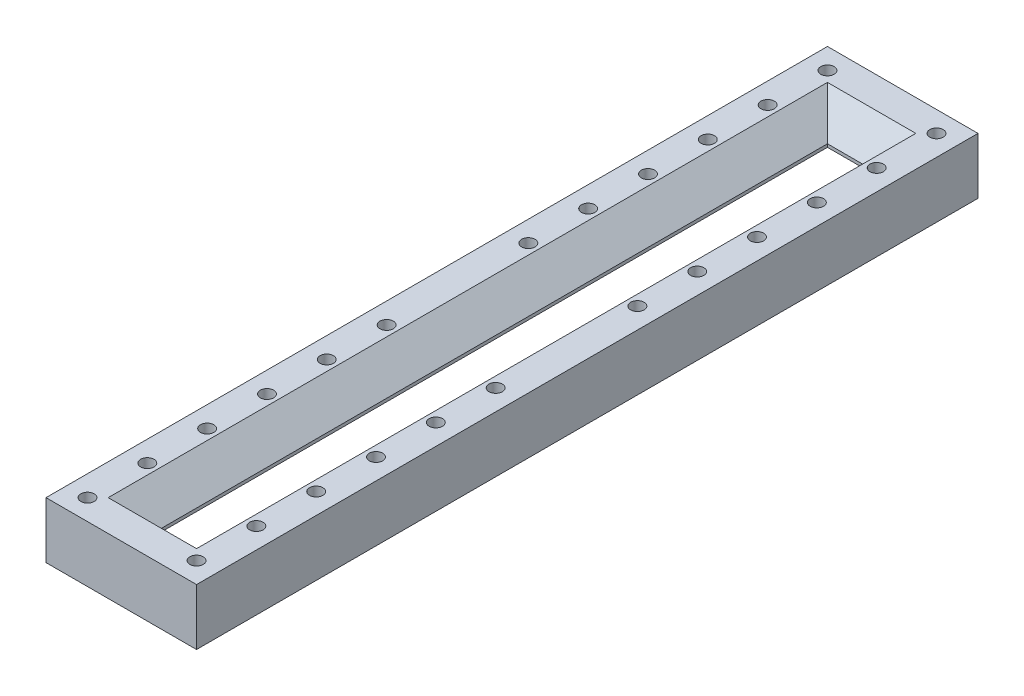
from build123d import *

# Parameters (mm, degrees)
SKETCH2_W           = 679.45
SKETCH2_H           = 3527.05
SKETCH2_W_2         = 158.75
SKETCH2_H_2         = 3006.35
BOSS_EXTRUDE2_DEPTH = 254
SKETCH3_R           = 30.1625
CUT_EXTRUDE1_DEPTH  = 1814.821794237
CHAMFER1_SIZE       = 120


with BuildPart() as part:
    # Sketch2 → Boss-Extrude2 (new body)
    with BuildSketch(Plane(origin=(0, 0, 0), x_dir=(-1, 0, 0), z_dir=(0, 1, 0))):
        Rectangle(SKETCH2_W, SKETCH2_H)
        Rectangle(SKETCH2_W_2, SKETCH2_H_2, mode=Mode.SUBTRACT)
    extrude(amount=BOSS_EXTRUDE2_DEPTH)

    # Sketch3 → Cut-Extrude1 (cut, through all)
    with BuildSketch(Plane(origin=(0, 0, 0), x_dir=(-1, 0, 0), z_dir=(0, 1, 0))):
        with Locations(Location((-246.0625, 1669.8625, 0), (0, 0, 90))):
            Circle(SKETCH3_R)
        with Locations(Location((246.0625, 1669.8625, 0), (0, 0, 90))):
            Circle(SKETCH3_R)
        with Locations(Location((-246.0625, 1399.8625, 0), (0, 0, 90))):
            Circle(SKETCH3_R)
        with Locations(Location((246.0625, 1399.8625, 0), (0, 0, 90))):
            Circle(SKETCH3_R)
        with Locations(Location((-246.0625, 1129.8625, 0), (0, 0, 90))):
            Circle(SKETCH3_R)
        with Locations(Location((246.0625, 1129.8625, 0), (0, 0, 90))):
            Circle(SKETCH3_R)
        with Locations(Location((-246.0625, 859.8625, 0), (0, 0, 90))):
            Circle(SKETCH3_R)
        with Locations(Location((246.0625, 859.8625, 0), (0, 0, 90))):
            Circle(SKETCH3_R)
        with Locations(Location((-246.0625, 589.8625, 0), (0, 0, 90))):
            Circle(SKETCH3_R)
        with Locations(Location((246.0625, 589.8625, 0), (0, 0, 90))):
            Circle(SKETCH3_R)
        with Locations(Location((-246.0625, -1669.8625, 0), (0, 0, 90))):
            Circle(SKETCH3_R)
        with Locations(Location((246.0625, -1669.8625, 0), (0, 0, 90))):
            Circle(SKETCH3_R)
        with Locations(Location((-246.0625, -1399.8625, 0), (0, 0, 90))):
            Circle(SKETCH3_R)
        with Locations(Location((246.0625, -1399.8625, 0), (0, 0, 90))):
            Circle(SKETCH3_R)
        with Locations(Location((-246.0625, -1129.8625, 0), (0, 0, 90))):
            Circle(SKETCH3_R)
        with Locations(Location((246.0625, -1129.8625, 0), (0, 0, 90))):
            Circle(SKETCH3_R)
        with Locations(Location((-246.0625, -859.8625, 0), (0, 0, 90))):
            Circle(SKETCH3_R)
        with Locations(Location((246.0625, -859.8625, 0), (0, 0, 90))):
            Circle(SKETCH3_R)
        with Locations(Location((-246.0625, -589.8625, 0), (0, 0, 90))):
            Circle(SKETCH3_R)
        with Locations(Location((246.0625, -589.8625, 0), (0, 0, 90))):
            Circle(SKETCH3_R)
        with Locations(Location((-246.0625, -319.8625, 0), (0, 0, 90))):
            Circle(SKETCH3_R)
        with Locations(Location((246.0625, -319.8625, 0), (0, 0, 90))):
            Circle(SKETCH3_R)
        with Locations(Location((-246.0625, 319.8625, 0), (0, 0, 90))):
            Circle(SKETCH3_R)
        with Locations(Location((246.0625, 319.8625, 0), (0, 0, 90))):
            Circle(SKETCH3_R)
    extrude(amount=CUT_EXTRUDE1_DEPTH, mode=Mode.SUBTRACT)

    # Chamfer1
    chamfer1_edges = [part.edges().sort_by_distance(p)[0] for p in [
        (-79.375, 0, 0),
        (0, 0, 1503.175),
        (79.375, 0, 0),
        (0, 0, -1503.175),
        (-79.375, 254, 0),
        (0, 254, 1503.175),
        (79.375, 254, 0),
        (0, 254, -1503.175),
    ]]
    chamfer(chamfer1_edges, length=CHAMFER1_SIZE)


solid = part.part
